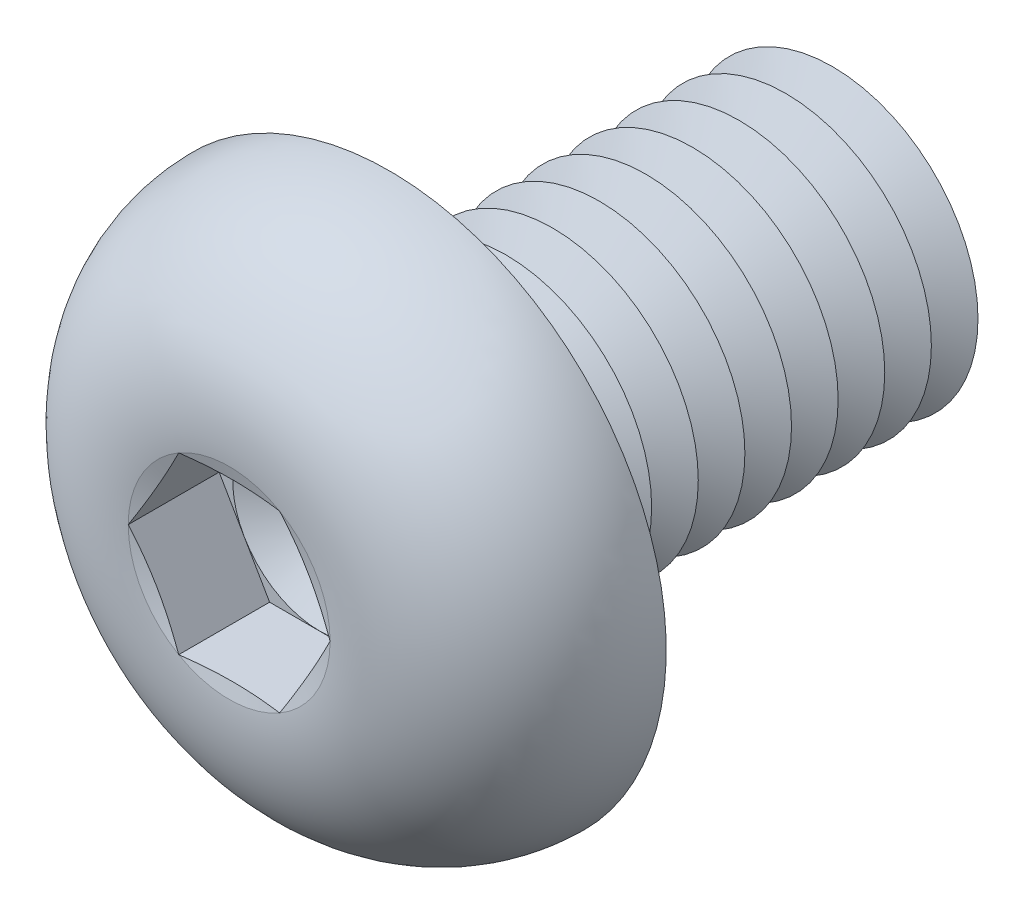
from build123d import *

# Parameters (mm, degrees)
FILLET1_R          = 0.4
LPATTERN1_COUNT    = 10
LPATTERN1_PITCH    = 0.8
CUT_EXTRUDE1_DEPTH = 1.56


with BuildPart() as part:
    # Sketch1 → Revolve1 (revolve)
    with BuildSketch(Plane(origin=(0, 0, 0), x_dir=(0, 0, -1), z_dir=(1, 0, 0)), mode=Mode.PRIVATE) as revolve1_sk:
        with BuildLine():
            Line((0, 2.5), (0, 4.75))
            ThreePointArc((0, 4.75), (-2.041477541, 3.848329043), (-2.75, 1.73205))
            Line((-2.75, 1.73205), (-2.517949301, 0.866025))
            Line((-2.517949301, 0.866025), (-2.75, 0.866025))
            Line((-2.75, 0.866025), (-2.75, 0))
            Line((-2.75, 0), (8, 0))
            Line((8, 0), (8, 2.5))
            Line((8, 2.5), (0, 2.5))
        make_face()
    revolve(revolve1_sk.sketch.rotate(Axis((0, 0, -8), (0, 0, 1)), 90), axis=Axis((0, 0, -8), (0, 0, 1)))

    # Fillet1
    fillet1_edges = [part.edges().sort_by_distance(p)[0] for p in [
        (2.5, 0, 0),
    ]]
    fillet(fillet1_edges, radius=FILLET1_R)

    # Sketch2 → Cut-Revolve1 (revolve, cut)
    with BuildSketch(Plane(origin=(0, 0, 0), x_dir=(0, 0, -1), z_dir=(1, 0, 0)), mode=Mode.PRIVATE) as cut_revolve1_sk:
        Polygon((7.6, 2.5), (8.4, 2.5), (8, 1.807179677), align=None)
    cut_revolve1 = revolve(cut_revolve1_sk.sketch.rotate(Axis((0, 0, -8), (0, 0, -1)), 270), axis=Axis((0, 0, -8), (0, 0, -1)), mode=Mode.SUBTRACT)

    # LPattern1: Cut-Revolve1 ×10
    with Locations(*[(0, 0, i * LPATTERN1_PITCH) for i in range(1, LPATTERN1_COUNT)]):
        add(cut_revolve1, mode=Mode.SUBTRACT)

    # Sketch3 → Cut-Extrude1 (cut)
    with BuildSketch(Plane.XY.offset(2.75)):
        Polygon((0.866025, 1.499999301), (-0.866025, 1.499999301), (-1.73205, 0), (-0.866025, -1.499999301), (0.866025, -1.499999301), (1.73205, 0), align=None)
    extrude(amount=-CUT_EXTRUDE1_DEPTH, mode=Mode.SUBTRACT)

    # Cut-Extrude2 cone 1 section (on through the dimple's axis) → Cut-Extrude2 (revolve, cut)
    with BuildSketch(Plane(origin=(0, 0, 1.19), x_dir=(0, -1, 0), z_dir=(1, 0, 0))):
        Polygon((0, 0), (1.499999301, 0), (0, 0.866025), align=None)
    revolve(axis=Axis((0, 0, 1.19), (0, 0, -1)), mode=Mode.SUBTRACT)


solid = part.part
